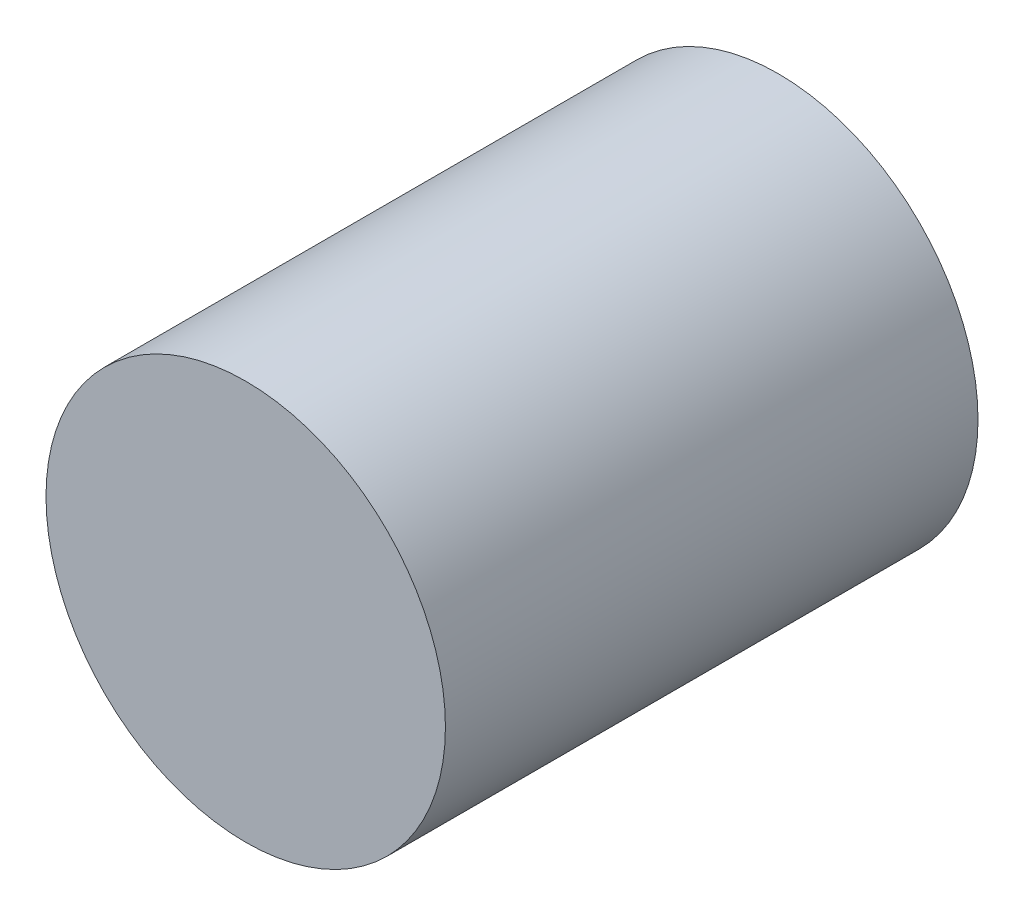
ISO-10303-21;
HEADER;
FILE_DESCRIPTION(('STEP AP214'),'2;1');
FILE_NAME('part.step','',(''),(''),'','','');
FILE_SCHEMA(('AUTOMOTIVE_DESIGN { 1 0 10303 214 1 1 1 1 }'));
ENDSEC;
DATA;
#1=APPLICATION_CONTEXT('core data for automotive mechanical design processes');
#2=APPLICATION_PROTOCOL_DEFINITION('international standard','automotive_design',2000,#1);
#3=PRODUCT_CONTEXT('',#1,'mechanical');
#4=PRODUCT('Part','Part','',(#3));
#5=PRODUCT_RELATED_PRODUCT_CATEGORY('part','',(#4));
#6=PRODUCT_DEFINITION_FORMATION('','',#4);
#7=PRODUCT_DEFINITION_CONTEXT('part definition',#1,'design');
#8=PRODUCT_DEFINITION('design','',#6,#7);
#9=PRODUCT_DEFINITION_SHAPE('','',#8);
#10=(LENGTH_UNIT() NAMED_UNIT(*) SI_UNIT(.MILLI.,.METRE.));
#11=(NAMED_UNIT(*) PLANE_ANGLE_UNIT() SI_UNIT($,.RADIAN.));
#12=(NAMED_UNIT(*) SI_UNIT($,.STERADIAN.) SOLID_ANGLE_UNIT());
#13=UNCERTAINTY_MEASURE_WITH_UNIT(LENGTH_MEASURE(1.E-05),#10,'distance_accuracy_value','');
#14=(GEOMETRIC_REPRESENTATION_CONTEXT(3) GLOBAL_UNCERTAINTY_ASSIGNED_CONTEXT((#13)) GLOBAL_UNIT_ASSIGNED_CONTEXT((#10,
#11,#12)) REPRESENTATION_CONTEXT('',''));
#15=CARTESIAN_POINT('',(0.,0.,0.));
#16=DIRECTION('',(0.,0.,1.));
#17=DIRECTION('',(1.,0.,0.));
#18=AXIS2_PLACEMENT_3D('',#15,#16,#17);
#19=CARTESIAN_POINT('',(0.,0.,3.));
#20=DIRECTION('',(0.,0.,-1.));
#21=DIRECTION('',(-1.,0.,0.));
#22=AXIS2_PLACEMENT_3D('',#19,#20,#21);
#23=CYLINDRICAL_SURFACE('',#22,1.125);
#24=CARTESIAN_POINT('',(0.,0.,3.));
#25=DIRECTION('',(0.,0.,1.));
#26=DIRECTION('',(1.,0.,0.));
#27=AXIS2_PLACEMENT_3D('',#24,#25,#26);
#28=CIRCLE('',#27,1.125);
#29=CARTESIAN_POINT('',(1.125,0.,3.));
#30=VERTEX_POINT('',#29);
#31=EDGE_CURVE('E10',#30,#30,#28,.T.);
#32=ORIENTED_EDGE('',*,*,#31,.F.);
#33=EDGE_LOOP('',(#32));
#34=FACE_BOUND('',#33,.T.);
#35=CARTESIAN_POINT('',(0.,0.,0.));
#36=DIRECTION('',(0.,0.,1.));
#37=DIRECTION('',(1.,0.,0.));
#38=AXIS2_PLACEMENT_3D('',#35,#36,#37);
#39=CIRCLE('',#38,1.125);
#40=CARTESIAN_POINT('',(1.125,0.,0.));
#41=VERTEX_POINT('',#40);
#42=EDGE_CURVE('E37',#41,#41,#39,.T.);
#43=ORIENTED_EDGE('',*,*,#42,.T.);
#44=EDGE_LOOP('',(#43));
#45=FACE_BOUND('',#44,.T.);
#46=ADVANCED_FACE('F31',(#34,#45),#23,.T.);
#47=CARTESIAN_POINT('',(0.,0.,3.));
#48=DIRECTION('',(0.,0.,1.));
#49=DIRECTION('',(1.,0.,0.));
#50=AXIS2_PLACEMENT_3D('',#47,#48,#49);
#51=PLANE('',#50);
#52=ORIENTED_EDGE('',*,*,#31,.T.);
#53=EDGE_LOOP('',(#52));
#54=FACE_BOUND('',#53,.T.);
#55=ADVANCED_FACE('F46',(#54),#51,.T.);
#56=CARTESIAN_POINT('',(0.,0.,0.));
#57=DIRECTION('',(0.,0.,1.));
#58=DIRECTION('',(1.,0.,0.));
#59=AXIS2_PLACEMENT_3D('',#56,#57,#58);
#60=PLANE('',#59);
#61=ORIENTED_EDGE('',*,*,#42,.F.);
#62=EDGE_LOOP('',(#61));
#63=FACE_BOUND('',#62,.T.);
#64=ADVANCED_FACE('F44',(#63),#60,.F.);
#65=CLOSED_SHELL('',(#46,#55,#64));
#66=MANIFOLD_SOLID_BREP('B2',#65);
#67=ADVANCED_BREP_SHAPE_REPRESENTATION('',(#18,#66),#14);
#68=SHAPE_DEFINITION_REPRESENTATION(#9,#67);
ENDSEC;
END-ISO-10303-21;
